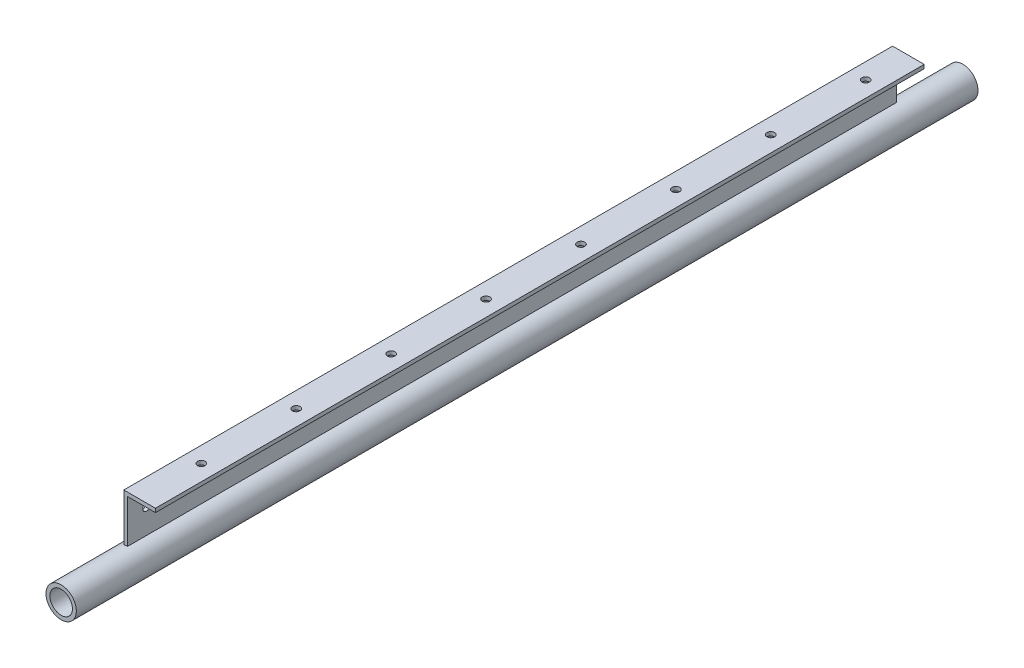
ISO-10303-21;
HEADER;
FILE_DESCRIPTION(('STEP AP214'),'2;1');
FILE_NAME('part.step','',(''),(''),'','','');
FILE_SCHEMA(('AUTOMOTIVE_DESIGN { 1 0 10303 214 1 1 1 1 }'));
ENDSEC;
DATA;
#1=APPLICATION_CONTEXT('core data for automotive mechanical design processes');
#2=APPLICATION_PROTOCOL_DEFINITION('international standard','automotive_design',2000,#1);
#3=PRODUCT_CONTEXT('',#1,'mechanical');
#4=PRODUCT('Part','Part','',(#3));
#5=PRODUCT_RELATED_PRODUCT_CATEGORY('part','',(#4));
#6=PRODUCT_DEFINITION_FORMATION('','',#4);
#7=PRODUCT_DEFINITION_CONTEXT('part definition',#1,'design');
#8=PRODUCT_DEFINITION('design','',#6,#7);
#9=PRODUCT_DEFINITION_SHAPE('','',#8);
#10=(LENGTH_UNIT() NAMED_UNIT(*) SI_UNIT(.MILLI.,.METRE.));
#11=(NAMED_UNIT(*) PLANE_ANGLE_UNIT() SI_UNIT($,.RADIAN.));
#12=(NAMED_UNIT(*) SI_UNIT($,.STERADIAN.) SOLID_ANGLE_UNIT());
#13=UNCERTAINTY_MEASURE_WITH_UNIT(LENGTH_MEASURE(1.E-05),#10,'distance_accuracy_value','');
#14=(GEOMETRIC_REPRESENTATION_CONTEXT(3) GLOBAL_UNCERTAINTY_ASSIGNED_CONTEXT((#13)) GLOBAL_UNIT_ASSIGNED_CONTEXT((#10,
#11,#12)) REPRESENTATION_CONTEXT('',''));
#15=CARTESIAN_POINT('',(0.,0.,0.));
#16=DIRECTION('',(0.,0.,1.));
#17=DIRECTION('',(1.,0.,0.));
#18=AXIS2_PLACEMENT_3D('',#15,#16,#17);
#19=CARTESIAN_POINT('',(0.,92.2379000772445,1425.));
#20=DIRECTION('',(0.,1.,0.));
#21=DIRECTION('',(0.,0.,1.));
#22=AXIS2_PLACEMENT_3D('',#19,#20,#21);
#23=PLANE('',#22);
#24=CARTESIAN_POINT('',(19.,92.2379000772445,322.5));
#25=DIRECTION('',(0.,1.,0.));
#26=DIRECTION('',(0.,0.,1.));
#27=AXIS2_PLACEMENT_3D('',#24,#25,#26);
#28=CIRCLE('',#27,6.00000000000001);
#29=CARTESIAN_POINT('',(19.,92.2379000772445,328.5));
#30=VERTEX_POINT('',#29);
#31=EDGE_CURVE('E658',#30,#30,#28,.T.);
#32=ORIENTED_EDGE('',*,*,#31,.T.);
#33=EDGE_LOOP('',(#32));
#34=FACE_BOUND('',#33,.T.);
#35=CARTESIAN_POINT('',(19.,92.2379000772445,172.5));
#36=DIRECTION('',(0.,1.,0.));
#37=DIRECTION('',(0.,0.,1.));
#38=AXIS2_PLACEMENT_3D('',#35,#36,#37);
#39=CIRCLE('',#38,6.00000000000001);
#40=CARTESIAN_POINT('',(19.,92.2379000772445,178.5));
#41=VERTEX_POINT('',#40);
#42=EDGE_CURVE('E652',#41,#41,#39,.T.);
#43=ORIENTED_EDGE('',*,*,#42,.T.);
#44=EDGE_LOOP('',(#43));
#45=FACE_BOUND('',#44,.T.);
#46=DIRECTION('',(-1.,0.,0.));
#47=VECTOR('',#46,1.);
#48=CARTESIAN_POINT('',(0.,92.2379000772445,105.));
#49=LINE('',#48,#47);
#50=CARTESIAN_POINT('',(44.,92.2379000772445,105.));
#51=VERTEX_POINT('',#50);
#52=CARTESIAN_POINT('',(0.,92.2379000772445,105.));
#53=VERTEX_POINT('',#52);
#54=EDGE_CURVE('E86',#51,#53,#49,.T.);
#55=ORIENTED_EDGE('',*,*,#54,.F.);
#56=DIRECTION('',(0.,0.,-1.));
#57=VECTOR('',#56,1.);
#58=CARTESIAN_POINT('',(44.,92.2379000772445,1425.));
#59=LINE('',#58,#57);
#60=CARTESIAN_POINT('',(44.,92.2379000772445,1320.));
#61=VERTEX_POINT('',#60);
#62=EDGE_CURVE('E100',#61,#51,#59,.T.);
#63=ORIENTED_EDGE('',*,*,#62,.F.);
#64=DIRECTION('',(1.,0.,0.));
#65=VECTOR('',#64,1.);
#66=CARTESIAN_POINT('',(0.,92.2379000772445,1320.));
#67=LINE('',#66,#65);
#68=CARTESIAN_POINT('',(0.,92.2379000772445,1320.));
#69=VERTEX_POINT('',#68);
#70=EDGE_CURVE('E637',#69,#61,#67,.T.);
#71=ORIENTED_EDGE('',*,*,#70,.F.);
#72=DIRECTION('',(0.,0.,-1.));
#73=VECTOR('',#72,1.);
#74=CARTESIAN_POINT('',(0.,92.2379000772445,1425.));
#75=LINE('',#74,#73);
#76=EDGE_CURVE('E102',#69,#53,#75,.T.);
#77=ORIENTED_EDGE('',*,*,#76,.T.);
#78=EDGE_LOOP('',(#55,#63,#71,#77));
#79=FACE_BOUND('',#78,.T.);
#80=CARTESIAN_POINT('',(19.,92.2379000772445,472.5));
#81=DIRECTION('',(0.,1.,0.));
#82=DIRECTION('',(0.,0.,1.));
#83=AXIS2_PLACEMENT_3D('',#80,#81,#82);
#84=CIRCLE('',#83,6.00000000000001);
#85=CARTESIAN_POINT('',(19.,92.2379000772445,478.5));
#86=VERTEX_POINT('',#85);
#87=EDGE_CURVE('E203',#86,#86,#84,.T.);
#88=ORIENTED_EDGE('',*,*,#87,.T.);
#89=EDGE_LOOP('',(#88));
#90=FACE_BOUND('',#89,.T.);
#91=CARTESIAN_POINT('',(19.,92.2379000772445,622.5));
#92=DIRECTION('',(0.,1.,0.));
#93=DIRECTION('',(0.,0.,1.));
#94=AXIS2_PLACEMENT_3D('',#91,#92,#93);
#95=CIRCLE('',#94,6.00000000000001);
#96=CARTESIAN_POINT('',(19.,92.2379000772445,628.5));
#97=VERTEX_POINT('',#96);
#98=EDGE_CURVE('E209',#97,#97,#95,.T.);
#99=ORIENTED_EDGE('',*,*,#98,.T.);
#100=EDGE_LOOP('',(#99));
#101=FACE_BOUND('',#100,.T.);
#102=CARTESIAN_POINT('',(19.,92.2379000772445,772.5));
#103=DIRECTION('',(0.,1.,0.));
#104=DIRECTION('',(0.,0.,1.));
#105=AXIS2_PLACEMENT_3D('',#102,#103,#104);
#106=CIRCLE('',#105,6.00000000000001);
#107=CARTESIAN_POINT('',(19.,92.2379000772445,778.5));
#108=VERTEX_POINT('',#107);
#109=EDGE_CURVE('E215',#108,#108,#106,.T.);
#110=ORIENTED_EDGE('',*,*,#109,.T.);
#111=EDGE_LOOP('',(#110));
#112=FACE_BOUND('',#111,.T.);
#113=CARTESIAN_POINT('',(19.,92.2379000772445,922.5));
#114=DIRECTION('',(0.,1.,0.));
#115=DIRECTION('',(0.,0.,1.));
#116=AXIS2_PLACEMENT_3D('',#113,#114,#115);
#117=CIRCLE('',#116,6.00000000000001);
#118=CARTESIAN_POINT('',(19.,92.2379000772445,928.5));
#119=VERTEX_POINT('',#118);
#120=EDGE_CURVE('E221',#119,#119,#117,.T.);
#121=ORIENTED_EDGE('',*,*,#120,.T.);
#122=EDGE_LOOP('',(#121));
#123=FACE_BOUND('',#122,.T.);
#124=CARTESIAN_POINT('',(19.,92.2379000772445,1072.5));
#125=DIRECTION('',(0.,1.,0.));
#126=DIRECTION('',(0.,0.,1.));
#127=AXIS2_PLACEMENT_3D('',#124,#125,#126);
#128=CIRCLE('',#127,6.00000000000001);
#129=CARTESIAN_POINT('',(19.,92.2379000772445,1078.5));
#130=VERTEX_POINT('',#129);
#131=EDGE_CURVE('E227',#130,#130,#128,.T.);
#132=ORIENTED_EDGE('',*,*,#131,.T.);
#133=EDGE_LOOP('',(#132));
#134=FACE_BOUND('',#133,.T.);
#135=CARTESIAN_POINT('',(19.,92.2379000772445,1222.5));
#136=DIRECTION('',(0.,1.,0.));
#137=DIRECTION('',(0.,0.,1.));
#138=AXIS2_PLACEMENT_3D('',#135,#136,#137);
#139=CIRCLE('',#138,6.00000000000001);
#140=CARTESIAN_POINT('',(19.,92.2379000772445,1228.5));
#141=VERTEX_POINT('',#140);
#142=EDGE_CURVE('E11',#141,#141,#139,.T.);
#143=ORIENTED_EDGE('',*,*,#142,.T.);
#144=EDGE_LOOP('',(#143));
#145=FACE_BOUND('',#144,.T.);
#146=ADVANCED_FACE('F32',(#34,#45,#79,#90,#101,#112,#123,#134,#145),#23,.F.);
#147=CARTESIAN_POINT('',(44.,98.2379000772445,1425.));
#148=DIRECTION('',(-1.,0.,0.));
#149=DIRECTION('',(0.,0.,1.));
#150=AXIS2_PLACEMENT_3D('',#147,#148,#149);
#151=PLANE('',#150);
#152=DIRECTION('',(0.,-1.,0.));
#153=VECTOR('',#152,1.);
#154=CARTESIAN_POINT('',(44.,92.2379000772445,105.));
#155=LINE('',#154,#153);
#156=CARTESIAN_POINT('',(44.,98.2379000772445,105.));
#157=VERTEX_POINT('',#156);
#158=EDGE_CURVE('E83',#157,#51,#155,.T.);
#159=ORIENTED_EDGE('',*,*,#158,.F.);
#160=DIRECTION('',(0.,0.,-1.));
#161=VECTOR('',#160,1.);
#162=CARTESIAN_POINT('',(44.,98.2379000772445,1425.));
#163=LINE('',#162,#161);
#164=CARTESIAN_POINT('',(44.,98.2379000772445,1320.));
#165=VERTEX_POINT('',#164);
#166=EDGE_CURVE('E108',#165,#157,#163,.T.);
#167=ORIENTED_EDGE('',*,*,#166,.F.);
#168=DIRECTION('',(0.,1.,0.));
#169=VECTOR('',#168,1.);
#170=CARTESIAN_POINT('',(44.,98.2379000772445,1320.));
#171=LINE('',#170,#169);
#172=EDGE_CURVE('E106',#61,#165,#171,.T.);
#173=ORIENTED_EDGE('',*,*,#172,.F.);
#174=ORIENTED_EDGE('',*,*,#62,.T.);
#175=EDGE_LOOP('',(#159,#167,#173,#174));
#176=FACE_BOUND('',#175,.T.);
#177=ADVANCED_FACE('F105',(#176),#151,.F.);
#178=CARTESIAN_POINT('',(-6.,98.2379000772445,1425.));
#179=DIRECTION('',(0.,-1.,0.));
#180=DIRECTION('',(0.,0.,-1.));
#181=AXIS2_PLACEMENT_3D('',#178,#179,#180);
#182=PLANE('',#181);
#183=CARTESIAN_POINT('',(19.,98.2379000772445,322.5));
#184=DIRECTION('',(0.,1.,0.));
#185=DIRECTION('',(0.,0.,1.));
#186=AXIS2_PLACEMENT_3D('',#183,#184,#185);
#187=CIRCLE('',#186,6.00000000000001);
#188=CARTESIAN_POINT('',(19.,98.2379000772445,328.5));
#189=VERTEX_POINT('',#188);
#190=EDGE_CURVE('E660',#189,#189,#187,.T.);
#191=ORIENTED_EDGE('',*,*,#190,.F.);
#192=EDGE_LOOP('',(#191));
#193=FACE_BOUND('',#192,.T.);
#194=CARTESIAN_POINT('',(19.,98.2379000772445,172.5));
#195=DIRECTION('',(0.,1.,0.));
#196=DIRECTION('',(0.,0.,1.));
#197=AXIS2_PLACEMENT_3D('',#194,#195,#196);
#198=CIRCLE('',#197,6.00000000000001);
#199=CARTESIAN_POINT('',(19.,98.2379000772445,178.5));
#200=VERTEX_POINT('',#199);
#201=EDGE_CURVE('E655',#200,#200,#198,.T.);
#202=ORIENTED_EDGE('',*,*,#201,.F.);
#203=EDGE_LOOP('',(#202));
#204=FACE_BOUND('',#203,.T.);
#205=DIRECTION('',(1.,0.,0.));
#206=VECTOR('',#205,1.);
#207=CARTESIAN_POINT('',(44.,98.2379000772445,105.));
#208=LINE('',#207,#206);
#209=CARTESIAN_POINT('',(-6.,98.2379000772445,105.));
#210=VERTEX_POINT('',#209);
#211=EDGE_CURVE('E88',#210,#157,#208,.T.);
#212=ORIENTED_EDGE('',*,*,#211,.F.);
#213=DIRECTION('',(0.,0.,-1.));
#214=VECTOR('',#213,1.);
#215=CARTESIAN_POINT('',(-6.,98.2379000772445,1425.));
#216=LINE('',#215,#214);
#217=CARTESIAN_POINT('',(-6.,98.2379000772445,1320.));
#218=VERTEX_POINT('',#217);
#219=EDGE_CURVE('E113',#218,#210,#216,.T.);
#220=ORIENTED_EDGE('',*,*,#219,.F.);
#221=DIRECTION('',(-1.,0.,0.));
#222=VECTOR('',#221,1.);
#223=CARTESIAN_POINT('',(-6.,98.2379000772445,1320.));
#224=LINE('',#223,#222);
#225=EDGE_CURVE('E603',#165,#218,#224,.T.);
#226=ORIENTED_EDGE('',*,*,#225,.F.);
#227=ORIENTED_EDGE('',*,*,#166,.T.);
#228=EDGE_LOOP('',(#212,#220,#226,#227));
#229=FACE_BOUND('',#228,.T.);
#230=CARTESIAN_POINT('',(19.,98.2379000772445,472.5));
#231=DIRECTION('',(0.,1.,0.));
#232=DIRECTION('',(0.,0.,1.));
#233=AXIS2_PLACEMENT_3D('',#230,#231,#232);
#234=CIRCLE('',#233,6.00000000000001);
#235=CARTESIAN_POINT('',(19.,98.2379000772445,478.5));
#236=VERTEX_POINT('',#235);
#237=EDGE_CURVE('E200',#236,#236,#234,.T.);
#238=ORIENTED_EDGE('',*,*,#237,.F.);
#239=EDGE_LOOP('',(#238));
#240=FACE_BOUND('',#239,.T.);
#241=CARTESIAN_POINT('',(19.,98.2379000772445,622.5));
#242=DIRECTION('',(0.,1.,0.));
#243=DIRECTION('',(0.,0.,1.));
#244=AXIS2_PLACEMENT_3D('',#241,#242,#243);
#245=CIRCLE('',#244,6.00000000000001);
#246=CARTESIAN_POINT('',(19.,98.2379000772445,628.5));
#247=VERTEX_POINT('',#246);
#248=EDGE_CURVE('E206',#247,#247,#245,.T.);
#249=ORIENTED_EDGE('',*,*,#248,.F.);
#250=EDGE_LOOP('',(#249));
#251=FACE_BOUND('',#250,.T.);
#252=CARTESIAN_POINT('',(19.,98.2379000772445,772.5));
#253=DIRECTION('',(0.,1.,0.));
#254=DIRECTION('',(0.,0.,1.));
#255=AXIS2_PLACEMENT_3D('',#252,#253,#254);
#256=CIRCLE('',#255,6.00000000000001);
#257=CARTESIAN_POINT('',(19.,98.2379000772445,778.5));
#258=VERTEX_POINT('',#257);
#259=EDGE_CURVE('E212',#258,#258,#256,.T.);
#260=ORIENTED_EDGE('',*,*,#259,.F.);
#261=EDGE_LOOP('',(#260));
#262=FACE_BOUND('',#261,.T.);
#263=CARTESIAN_POINT('',(19.,98.2379000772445,922.5));
#264=DIRECTION('',(0.,1.,0.));
#265=DIRECTION('',(0.,0.,1.));
#266=AXIS2_PLACEMENT_3D('',#263,#264,#265);
#267=CIRCLE('',#266,6.00000000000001);
#268=CARTESIAN_POINT('',(19.,98.2379000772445,928.5));
#269=VERTEX_POINT('',#268);
#270=EDGE_CURVE('E218',#269,#269,#267,.T.);
#271=ORIENTED_EDGE('',*,*,#270,.F.);
#272=EDGE_LOOP('',(#271));
#273=FACE_BOUND('',#272,.T.);
#274=CARTESIAN_POINT('',(19.,98.2379000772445,1072.5));
#275=DIRECTION('',(0.,1.,0.));
#276=DIRECTION('',(0.,0.,1.));
#277=AXIS2_PLACEMENT_3D('',#274,#275,#276);
#278=CIRCLE('',#277,6.00000000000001);
#279=CARTESIAN_POINT('',(19.,98.2379000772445,1078.5));
#280=VERTEX_POINT('',#279);
#281=EDGE_CURVE('E224',#280,#280,#278,.T.);
#282=ORIENTED_EDGE('',*,*,#281,.F.);
#283=EDGE_LOOP('',(#282));
#284=FACE_BOUND('',#283,.T.);
#285=CARTESIAN_POINT('',(19.,98.2379000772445,1222.5));
#286=DIRECTION('',(0.,1.,0.));
#287=DIRECTION('',(0.,0.,1.));
#288=AXIS2_PLACEMENT_3D('',#285,#286,#287);
#289=CIRCLE('',#288,6.00000000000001);
#290=CARTESIAN_POINT('',(19.,98.2379000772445,1228.5));
#291=VERTEX_POINT('',#290);
#292=EDGE_CURVE('E40',#291,#291,#289,.T.);
#293=ORIENTED_EDGE('',*,*,#292,.F.);
#294=EDGE_LOOP('',(#293));
#295=FACE_BOUND('',#294,.T.);
#296=ADVANCED_FACE('F234',(#193,#204,#229,#240,#251,#262,#273,#284,#295),#182,.F.);
#297=CARTESIAN_POINT('',(-6.,98.2379000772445,1425.));
#298=DIRECTION('',(1.,0.,0.));
#299=DIRECTION('',(0.,1.,0.));
#300=AXIS2_PLACEMENT_3D('',#297,#298,#299);
#301=PLANE('',#300);
#302=CARTESIAN_POINT('',(-6.,63.2379000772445,1215.));
#303=DIRECTION('',(-1.,0.,0.));
#304=DIRECTION('',(0.,-1.,0.));
#305=AXIS2_PLACEMENT_3D('',#302,#303,#304);
#306=CIRCLE('',#305,6.0000000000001);
#307=CARTESIAN_POINT('',(-6.,57.2379000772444,1215.));
#308=VERTEX_POINT('',#307);
#309=EDGE_CURVE('E649',#308,#308,#306,.T.);
#310=ORIENTED_EDGE('',*,*,#309,.F.);
#311=EDGE_LOOP('',(#310));
#312=FACE_BOUND('',#311,.T.);
#313=CARTESIAN_POINT('',(-6.,63.2379000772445,1290.));
#314=DIRECTION('',(-1.,0.,0.));
#315=DIRECTION('',(0.,-1.,0.));
#316=AXIS2_PLACEMENT_3D('',#313,#314,#315);
#317=CIRCLE('',#316,6.0000000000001);
#318=CARTESIAN_POINT('',(-6.,57.2379000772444,1290.));
#319=VERTEX_POINT('',#318);
#320=EDGE_CURVE('E118',#319,#319,#317,.T.);
#321=ORIENTED_EDGE('',*,*,#320,.F.);
#322=EDGE_LOOP('',(#321));
#323=FACE_BOUND('',#322,.T.);
#324=DIRECTION('',(0.,1.,0.));
#325=VECTOR('',#324,1.);
#326=CARTESIAN_POINT('',(-5.99999999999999,23.2379000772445,105.));
#327=LINE('',#326,#325);
#328=CARTESIAN_POINT('',(-5.99999999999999,23.2379000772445,105.));
#329=VERTEX_POINT('',#328);
#330=EDGE_CURVE('E625',#329,#210,#327,.T.);
#331=ORIENTED_EDGE('',*,*,#330,.F.);
#332=DIRECTION('',(0.,0.,-1.));
#333=VECTOR('',#332,1.);
#334=CARTESIAN_POINT('',(-5.99999999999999,23.2379000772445,1425.));
#335=LINE('',#334,#333);
#336=CARTESIAN_POINT('',(-5.99999999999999,23.2379000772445,1320.));
#337=VERTEX_POINT('',#336);
#338=EDGE_CURVE('E616',#337,#329,#335,.T.);
#339=ORIENTED_EDGE('',*,*,#338,.F.);
#340=DIRECTION('',(0.,-1.,0.));
#341=VECTOR('',#340,1.);
#342=CARTESIAN_POINT('',(-6.,98.2379000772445,1320.));
#343=LINE('',#342,#341);
#344=EDGE_CURVE('E599',#218,#337,#343,.T.);
#345=ORIENTED_EDGE('',*,*,#344,.F.);
#346=ORIENTED_EDGE('',*,*,#219,.T.);
#347=EDGE_LOOP('',(#331,#339,#345,#346));
#348=FACE_BOUND('',#347,.T.);
#349=CARTESIAN_POINT('',(-6.,63.2379000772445,1140.));
#350=DIRECTION('',(-1.,0.,0.));
#351=DIRECTION('',(0.,-1.,0.));
#352=AXIS2_PLACEMENT_3D('',#349,#350,#351);
#353=CIRCLE('',#352,6.0000000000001);
#354=CARTESIAN_POINT('',(-6.,57.2379000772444,1140.));
#355=VERTEX_POINT('',#354);
#356=EDGE_CURVE('E107',#355,#355,#353,.T.);
#357=ORIENTED_EDGE('',*,*,#356,.F.);
#358=EDGE_LOOP('',(#357));
#359=FACE_BOUND('',#358,.T.);
#360=CARTESIAN_POINT('',(-6.,63.2379000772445,1065.));
#361=DIRECTION('',(-1.,0.,0.));
#362=DIRECTION('',(0.,-1.,0.));
#363=AXIS2_PLACEMENT_3D('',#360,#361,#362);
#364=CIRCLE('',#363,6.0000000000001);
#365=CARTESIAN_POINT('',(-6.,57.2379000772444,1065.));
#366=VERTEX_POINT('',#365);
#367=EDGE_CURVE('E122',#366,#366,#364,.T.);
#368=ORIENTED_EDGE('',*,*,#367,.F.);
#369=EDGE_LOOP('',(#368));
#370=FACE_BOUND('',#369,.T.);
#371=CARTESIAN_POINT('',(-6.,63.2379000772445,990.));
#372=DIRECTION('',(-1.,0.,0.));
#373=DIRECTION('',(0.,-1.,0.));
#374=AXIS2_PLACEMENT_3D('',#371,#372,#373);
#375=CIRCLE('',#374,6.0000000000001);
#376=CARTESIAN_POINT('',(-6.,57.2379000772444,990.));
#377=VERTEX_POINT('',#376);
#378=EDGE_CURVE('E128',#377,#377,#375,.T.);
#379=ORIENTED_EDGE('',*,*,#378,.F.);
#380=EDGE_LOOP('',(#379));
#381=FACE_BOUND('',#380,.T.);
#382=CARTESIAN_POINT('',(-6.,63.2379000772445,915.));
#383=DIRECTION('',(-1.,0.,0.));
#384=DIRECTION('',(0.,-1.,0.));
#385=AXIS2_PLACEMENT_3D('',#382,#383,#384);
#386=CIRCLE('',#385,6.0000000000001);
#387=CARTESIAN_POINT('',(-6.,57.2379000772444,915.));
#388=VERTEX_POINT('',#387);
#389=EDGE_CURVE('E134',#388,#388,#386,.T.);
#390=ORIENTED_EDGE('',*,*,#389,.F.);
#391=EDGE_LOOP('',(#390));
#392=FACE_BOUND('',#391,.T.);
#393=CARTESIAN_POINT('',(-6.,63.2379000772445,840.));
#394=DIRECTION('',(-1.,0.,0.));
#395=DIRECTION('',(0.,-1.,0.));
#396=AXIS2_PLACEMENT_3D('',#393,#394,#395);
#397=CIRCLE('',#396,6.0000000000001);
#398=CARTESIAN_POINT('',(-6.,57.2379000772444,840.));
#399=VERTEX_POINT('',#398);
#400=EDGE_CURVE('E140',#399,#399,#397,.T.);
#401=ORIENTED_EDGE('',*,*,#400,.F.);
#402=EDGE_LOOP('',(#401));
#403=FACE_BOUND('',#402,.T.);
#404=CARTESIAN_POINT('',(-6.,63.2379000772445,765.));
#405=DIRECTION('',(-1.,0.,0.));
#406=DIRECTION('',(0.,-1.,0.));
#407=AXIS2_PLACEMENT_3D('',#404,#405,#406);
#408=CIRCLE('',#407,6.0000000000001);
#409=CARTESIAN_POINT('',(-6.,57.2379000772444,765.));
#410=VERTEX_POINT('',#409);
#411=EDGE_CURVE('E146',#410,#410,#408,.T.);
#412=ORIENTED_EDGE('',*,*,#411,.F.);
#413=EDGE_LOOP('',(#412));
#414=FACE_BOUND('',#413,.T.);
#415=CARTESIAN_POINT('',(-6.,63.2379000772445,690.));
#416=DIRECTION('',(-1.,0.,0.));
#417=DIRECTION('',(0.,-1.,0.));
#418=AXIS2_PLACEMENT_3D('',#415,#416,#417);
#419=CIRCLE('',#418,6.0000000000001);
#420=CARTESIAN_POINT('',(-5.99999999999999,57.2379000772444,690.));
#421=VERTEX_POINT('',#420);
#422=EDGE_CURVE('E152',#421,#421,#419,.T.);
#423=ORIENTED_EDGE('',*,*,#422,.F.);
#424=EDGE_LOOP('',(#423));
#425=FACE_BOUND('',#424,.T.);
#426=CARTESIAN_POINT('',(-6.,63.2379000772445,615.));
#427=DIRECTION('',(-1.,0.,0.));
#428=DIRECTION('',(0.,-1.,0.));
#429=AXIS2_PLACEMENT_3D('',#426,#427,#428);
#430=CIRCLE('',#429,6.0000000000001);
#431=CARTESIAN_POINT('',(-5.99999999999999,57.2379000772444,615.));
#432=VERTEX_POINT('',#431);
#433=EDGE_CURVE('E158',#432,#432,#430,.T.);
#434=ORIENTED_EDGE('',*,*,#433,.F.);
#435=EDGE_LOOP('',(#434));
#436=FACE_BOUND('',#435,.T.);
#437=CARTESIAN_POINT('',(-5.99999999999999,63.2379000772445,540.));
#438=DIRECTION('',(-1.,0.,0.));
#439=DIRECTION('',(0.,-1.,0.));
#440=AXIS2_PLACEMENT_3D('',#437,#438,#439);
#441=CIRCLE('',#440,6.0000000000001);
#442=CARTESIAN_POINT('',(-5.99999999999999,57.2379000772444,540.));
#443=VERTEX_POINT('',#442);
#444=EDGE_CURVE('E164',#443,#443,#441,.T.);
#445=ORIENTED_EDGE('',*,*,#444,.F.);
#446=EDGE_LOOP('',(#445));
#447=FACE_BOUND('',#446,.T.);
#448=CARTESIAN_POINT('',(-5.99999999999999,63.2379000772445,465.));
#449=DIRECTION('',(-1.,0.,0.));
#450=DIRECTION('',(0.,-1.,0.));
#451=AXIS2_PLACEMENT_3D('',#448,#449,#450);
#452=CIRCLE('',#451,6.0000000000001);
#453=CARTESIAN_POINT('',(-5.99999999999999,57.2379000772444,465.));
#454=VERTEX_POINT('',#453);
#455=EDGE_CURVE('E170',#454,#454,#452,.T.);
#456=ORIENTED_EDGE('',*,*,#455,.F.);
#457=EDGE_LOOP('',(#456));
#458=FACE_BOUND('',#457,.T.);
#459=CARTESIAN_POINT('',(-5.99999999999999,63.2379000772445,390.));
#460=DIRECTION('',(-1.,0.,0.));
#461=DIRECTION('',(0.,-1.,0.));
#462=AXIS2_PLACEMENT_3D('',#459,#460,#461);
#463=CIRCLE('',#462,6.0000000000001);
#464=CARTESIAN_POINT('',(-5.99999999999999,57.2379000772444,390.));
#465=VERTEX_POINT('',#464);
#466=EDGE_CURVE('E176',#465,#465,#463,.T.);
#467=ORIENTED_EDGE('',*,*,#466,.F.);
#468=EDGE_LOOP('',(#467));
#469=FACE_BOUND('',#468,.T.);
#470=CARTESIAN_POINT('',(-5.99999999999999,63.2379000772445,315.));
#471=DIRECTION('',(-1.,0.,0.));
#472=DIRECTION('',(0.,-1.,0.));
#473=AXIS2_PLACEMENT_3D('',#470,#471,#472);
#474=CIRCLE('',#473,6.0000000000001);
#475=CARTESIAN_POINT('',(-5.99999999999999,57.2379000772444,315.));
#476=VERTEX_POINT('',#475);
#477=EDGE_CURVE('E182',#476,#476,#474,.T.);
#478=ORIENTED_EDGE('',*,*,#477,.F.);
#479=EDGE_LOOP('',(#478));
#480=FACE_BOUND('',#479,.T.);
#481=CARTESIAN_POINT('',(-5.99999999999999,63.2379000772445,240.));
#482=DIRECTION('',(-1.,0.,0.));
#483=DIRECTION('',(0.,-1.,0.));
#484=AXIS2_PLACEMENT_3D('',#481,#482,#483);
#485=CIRCLE('',#484,6.0000000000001);
#486=CARTESIAN_POINT('',(-5.99999999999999,57.2379000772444,240.));
#487=VERTEX_POINT('',#486);
#488=EDGE_CURVE('E188',#487,#487,#485,.T.);
#489=ORIENTED_EDGE('',*,*,#488,.F.);
#490=EDGE_LOOP('',(#489));
#491=FACE_BOUND('',#490,.T.);
#492=CARTESIAN_POINT('',(-5.99999999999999,63.2379000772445,165.));
#493=DIRECTION('',(-1.,0.,0.));
#494=DIRECTION('',(0.,-1.,0.));
#495=AXIS2_PLACEMENT_3D('',#492,#493,#494);
#496=CIRCLE('',#495,6.0000000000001);
#497=CARTESIAN_POINT('',(-5.99999999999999,57.2379000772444,165.));
#498=VERTEX_POINT('',#497);
#499=EDGE_CURVE('E194',#498,#498,#496,.T.);
#500=ORIENTED_EDGE('',*,*,#499,.F.);
#501=EDGE_LOOP('',(#500));
#502=FACE_BOUND('',#501,.T.);
#503=ADVANCED_FACE('F236',(#312,#323,#348,#359,#370,#381,#392,#403,#414,#425,#436,#447,#458,
#469,#480,#491,#502),#301,.F.);
#504=CARTESIAN_POINT('',(0.,92.2379000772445,1425.));
#505=DIRECTION('',(-1.,0.,0.));
#506=DIRECTION('',(0.,-1.,0.));
#507=AXIS2_PLACEMENT_3D('',#504,#505,#506);
#508=PLANE('',#507);
#509=CARTESIAN_POINT('',(0.,63.2379000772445,1215.));
#510=DIRECTION('',(-1.,0.,0.));
#511=DIRECTION('',(0.,-1.,0.));
#512=AXIS2_PLACEMENT_3D('',#509,#510,#511);
#513=CIRCLE('',#512,6.0000000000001);
#514=CARTESIAN_POINT('',(0.,57.2379000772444,1215.));
#515=VERTEX_POINT('',#514);
#516=EDGE_CURVE('E646',#515,#515,#513,.T.);
#517=ORIENTED_EDGE('',*,*,#516,.T.);
#518=EDGE_LOOP('',(#517));
#519=FACE_BOUND('',#518,.T.);
#520=CARTESIAN_POINT('',(0.,63.2379000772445,1290.));
#521=DIRECTION('',(-1.,0.,0.));
#522=DIRECTION('',(0.,-1.,0.));
#523=AXIS2_PLACEMENT_3D('',#520,#521,#522);
#524=CIRCLE('',#523,6.0000000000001);
#525=CARTESIAN_POINT('',(0.,57.2379000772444,1290.));
#526=VERTEX_POINT('',#525);
#527=EDGE_CURVE('E93',#526,#526,#524,.T.);
#528=ORIENTED_EDGE('',*,*,#527,.T.);
#529=EDGE_LOOP('',(#528));
#530=FACE_BOUND('',#529,.T.);
#531=DIRECTION('',(0.,-1.,0.));
#532=VECTOR('',#531,1.);
#533=CARTESIAN_POINT('',(0.,24.,105.));
#534=LINE('',#533,#532);
#535=CARTESIAN_POINT('',(0.,24.,105.));
#536=VERTEX_POINT('',#535);
#537=EDGE_CURVE('E47',#53,#536,#534,.T.);
#538=ORIENTED_EDGE('',*,*,#537,.F.);
#539=ORIENTED_EDGE('',*,*,#76,.F.);
#540=DIRECTION('',(0.,1.,0.));
#541=VECTOR('',#540,1.);
#542=CARTESIAN_POINT('',(0.,92.2379000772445,1320.));
#543=LINE('',#542,#541);
#544=CARTESIAN_POINT('',(0.,24.,1320.));
#545=VERTEX_POINT('',#544);
#546=EDGE_CURVE('E630',#545,#69,#543,.T.);
#547=ORIENTED_EDGE('',*,*,#546,.F.);
#548=DIRECTION('',(0.,0.,-1.));
#549=VECTOR('',#548,1.);
#550=CARTESIAN_POINT('',(0.,24.,1425.));
#551=LINE('',#550,#549);
#552=EDGE_CURVE('E613',#545,#536,#551,.T.);
#553=ORIENTED_EDGE('',*,*,#552,.T.);
#554=EDGE_LOOP('',(#538,#539,#547,#553));
#555=FACE_BOUND('',#554,.T.);
#556=CARTESIAN_POINT('',(0.,63.2379000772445,1140.));
#557=DIRECTION('',(-1.,0.,0.));
#558=DIRECTION('',(0.,-1.,0.));
#559=AXIS2_PLACEMENT_3D('',#556,#557,#558);
#560=CIRCLE('',#559,6.0000000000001);
#561=CARTESIAN_POINT('',(0.,57.2379000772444,1140.));
#562=VERTEX_POINT('',#561);
#563=EDGE_CURVE('E111',#562,#562,#560,.T.);
#564=ORIENTED_EDGE('',*,*,#563,.T.);
#565=EDGE_LOOP('',(#564));
#566=FACE_BOUND('',#565,.T.);
#567=CARTESIAN_POINT('',(0.,63.2379000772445,1065.));
#568=DIRECTION('',(-1.,0.,0.));
#569=DIRECTION('',(0.,-1.,0.));
#570=AXIS2_PLACEMENT_3D('',#567,#568,#569);
#571=CIRCLE('',#570,6.0000000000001);
#572=CARTESIAN_POINT('',(0.,57.2379000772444,1065.));
#573=VERTEX_POINT('',#572);
#574=EDGE_CURVE('E125',#573,#573,#571,.T.);
#575=ORIENTED_EDGE('',*,*,#574,.T.);
#576=EDGE_LOOP('',(#575));
#577=FACE_BOUND('',#576,.T.);
#578=CARTESIAN_POINT('',(0.,63.2379000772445,990.));
#579=DIRECTION('',(-1.,0.,0.));
#580=DIRECTION('',(0.,-1.,0.));
#581=AXIS2_PLACEMENT_3D('',#578,#579,#580);
#582=CIRCLE('',#581,6.0000000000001);
#583=CARTESIAN_POINT('',(0.,57.2379000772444,990.));
#584=VERTEX_POINT('',#583);
#585=EDGE_CURVE('E131',#584,#584,#582,.T.);
#586=ORIENTED_EDGE('',*,*,#585,.T.);
#587=EDGE_LOOP('',(#586));
#588=FACE_BOUND('',#587,.T.);
#589=CARTESIAN_POINT('',(0.,63.2379000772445,915.));
#590=DIRECTION('',(-1.,0.,0.));
#591=DIRECTION('',(0.,-1.,0.));
#592=AXIS2_PLACEMENT_3D('',#589,#590,#591);
#593=CIRCLE('',#592,6.0000000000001);
#594=CARTESIAN_POINT('',(0.,57.2379000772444,915.));
#595=VERTEX_POINT('',#594);
#596=EDGE_CURVE('E137',#595,#595,#593,.T.);
#597=ORIENTED_EDGE('',*,*,#596,.T.);
#598=EDGE_LOOP('',(#597));
#599=FACE_BOUND('',#598,.T.);
#600=CARTESIAN_POINT('',(0.,63.2379000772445,840.));
#601=DIRECTION('',(-1.,0.,0.));
#602=DIRECTION('',(0.,-1.,0.));
#603=AXIS2_PLACEMENT_3D('',#600,#601,#602);
#604=CIRCLE('',#603,6.0000000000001);
#605=CARTESIAN_POINT('',(0.,57.2379000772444,840.));
#606=VERTEX_POINT('',#605);
#607=EDGE_CURVE('E143',#606,#606,#604,.T.);
#608=ORIENTED_EDGE('',*,*,#607,.T.);
#609=EDGE_LOOP('',(#608));
#610=FACE_BOUND('',#609,.T.);
#611=CARTESIAN_POINT('',(0.,63.2379000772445,765.));
#612=DIRECTION('',(-1.,0.,0.));
#613=DIRECTION('',(0.,-1.,0.));
#614=AXIS2_PLACEMENT_3D('',#611,#612,#613);
#615=CIRCLE('',#614,6.0000000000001);
#616=CARTESIAN_POINT('',(0.,57.2379000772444,765.));
#617=VERTEX_POINT('',#616);
#618=EDGE_CURVE('E149',#617,#617,#615,.T.);
#619=ORIENTED_EDGE('',*,*,#618,.T.);
#620=EDGE_LOOP('',(#619));
#621=FACE_BOUND('',#620,.T.);
#622=CARTESIAN_POINT('',(0.,63.2379000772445,690.));
#623=DIRECTION('',(-1.,0.,0.));
#624=DIRECTION('',(0.,-1.,0.));
#625=AXIS2_PLACEMENT_3D('',#622,#623,#624);
#626=CIRCLE('',#625,6.0000000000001);
#627=CARTESIAN_POINT('',(0.,57.2379000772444,690.));
#628=VERTEX_POINT('',#627);
#629=EDGE_CURVE('E155',#628,#628,#626,.T.);
#630=ORIENTED_EDGE('',*,*,#629,.T.);
#631=EDGE_LOOP('',(#630));
#632=FACE_BOUND('',#631,.T.);
#633=CARTESIAN_POINT('',(0.,63.2379000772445,615.));
#634=DIRECTION('',(-1.,0.,0.));
#635=DIRECTION('',(0.,-1.,0.));
#636=AXIS2_PLACEMENT_3D('',#633,#634,#635);
#637=CIRCLE('',#636,6.0000000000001);
#638=CARTESIAN_POINT('',(0.,57.2379000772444,615.));
#639=VERTEX_POINT('',#638);
#640=EDGE_CURVE('E161',#639,#639,#637,.T.);
#641=ORIENTED_EDGE('',*,*,#640,.T.);
#642=EDGE_LOOP('',(#641));
#643=FACE_BOUND('',#642,.T.);
#644=CARTESIAN_POINT('',(0.,63.2379000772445,540.));
#645=DIRECTION('',(-1.,0.,0.));
#646=DIRECTION('',(0.,-1.,0.));
#647=AXIS2_PLACEMENT_3D('',#644,#645,#646);
#648=CIRCLE('',#647,6.0000000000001);
#649=CARTESIAN_POINT('',(0.,57.2379000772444,540.));
#650=VERTEX_POINT('',#649);
#651=EDGE_CURVE('E167',#650,#650,#648,.T.);
#652=ORIENTED_EDGE('',*,*,#651,.T.);
#653=EDGE_LOOP('',(#652));
#654=FACE_BOUND('',#653,.T.);
#655=CARTESIAN_POINT('',(0.,63.2379000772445,465.));
#656=DIRECTION('',(-1.,0.,0.));
#657=DIRECTION('',(0.,-1.,0.));
#658=AXIS2_PLACEMENT_3D('',#655,#656,#657);
#659=CIRCLE('',#658,6.0000000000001);
#660=CARTESIAN_POINT('',(0.,57.2379000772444,465.));
#661=VERTEX_POINT('',#660);
#662=EDGE_CURVE('E173',#661,#661,#659,.T.);
#663=ORIENTED_EDGE('',*,*,#662,.T.);
#664=EDGE_LOOP('',(#663));
#665=FACE_BOUND('',#664,.T.);
#666=CARTESIAN_POINT('',(0.,63.2379000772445,390.));
#667=DIRECTION('',(-1.,0.,0.));
#668=DIRECTION('',(0.,-1.,0.));
#669=AXIS2_PLACEMENT_3D('',#666,#667,#668);
#670=CIRCLE('',#669,6.0000000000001);
#671=CARTESIAN_POINT('',(0.,57.2379000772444,390.));
#672=VERTEX_POINT('',#671);
#673=EDGE_CURVE('E179',#672,#672,#670,.T.);
#674=ORIENTED_EDGE('',*,*,#673,.T.);
#675=EDGE_LOOP('',(#674));
#676=FACE_BOUND('',#675,.T.);
#677=CARTESIAN_POINT('',(0.,63.2379000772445,315.));
#678=DIRECTION('',(-1.,0.,0.));
#679=DIRECTION('',(0.,-1.,0.));
#680=AXIS2_PLACEMENT_3D('',#677,#678,#679);
#681=CIRCLE('',#680,6.0000000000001);
#682=CARTESIAN_POINT('',(0.,57.2379000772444,315.));
#683=VERTEX_POINT('',#682);
#684=EDGE_CURVE('E185',#683,#683,#681,.T.);
#685=ORIENTED_EDGE('',*,*,#684,.T.);
#686=EDGE_LOOP('',(#685));
#687=FACE_BOUND('',#686,.T.);
#688=CARTESIAN_POINT('',(0.,63.2379000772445,240.));
#689=DIRECTION('',(-1.,0.,0.));
#690=DIRECTION('',(0.,-1.,0.));
#691=AXIS2_PLACEMENT_3D('',#688,#689,#690);
#692=CIRCLE('',#691,6.0000000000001);
#693=CARTESIAN_POINT('',(0.,57.2379000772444,240.));
#694=VERTEX_POINT('',#693);
#695=EDGE_CURVE('E191',#694,#694,#692,.T.);
#696=ORIENTED_EDGE('',*,*,#695,.T.);
#697=EDGE_LOOP('',(#696));
#698=FACE_BOUND('',#697,.T.);
#699=CARTESIAN_POINT('',(0.,63.2379000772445,165.));
#700=DIRECTION('',(-1.,0.,0.));
#701=DIRECTION('',(0.,-1.,0.));
#702=AXIS2_PLACEMENT_3D('',#699,#700,#701);
#703=CIRCLE('',#702,6.0000000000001);
#704=CARTESIAN_POINT('',(0.,57.2379000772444,165.));
#705=VERTEX_POINT('',#704);
#706=EDGE_CURVE('E197',#705,#705,#703,.T.);
#707=ORIENTED_EDGE('',*,*,#706,.T.);
#708=EDGE_LOOP('',(#707));
#709=FACE_BOUND('',#708,.T.);
#710=ADVANCED_FACE('F243',(#519,#530,#555,#566,#577,#588,#599,#610,#621,#632,#643,#654,#665,
#676,#687,#698,#709),#508,.F.);
#711=CARTESIAN_POINT('',(0.,0.,1425.));
#712=DIRECTION('',(0.,0.,1.));
#713=DIRECTION('',(1.,0.,0.));
#714=AXIS2_PLACEMENT_3D('',#711,#712,#713);
#715=PLANE('',#714);
#716=CARTESIAN_POINT('',(0.,0.,1425.));
#717=DIRECTION('',(0.,0.,1.));
#718=DIRECTION('',(1.,0.,0.));
#719=AXIS2_PLACEMENT_3D('',#716,#717,#718);
#720=CIRCLE('',#719,24.);
#721=CARTESIAN_POINT('',(24.,0.,1425.));
#722=VERTEX_POINT('',#721);
#723=EDGE_CURVE('E609',#722,#722,#720,.T.);
#724=ORIENTED_EDGE('',*,*,#723,.T.);
#725=EDGE_LOOP('',(#724));
#726=FACE_BOUND('',#725,.T.);
#727=CARTESIAN_POINT('',(0.,0.,1425.));
#728=DIRECTION('',(0.,0.,1.));
#729=DIRECTION('',(1.,0.,0.));
#730=AXIS2_PLACEMENT_3D('',#727,#728,#729);
#731=CIRCLE('',#730,17.85);
#732=CARTESIAN_POINT('',(17.85,0.,1425.));
#733=VERTEX_POINT('',#732);
#734=EDGE_CURVE('E594',#733,#733,#731,.T.);
#735=ORIENTED_EDGE('',*,*,#734,.F.);
#736=EDGE_LOOP('',(#735));
#737=FACE_BOUND('',#736,.T.);
#738=ADVANCED_FACE('F508',(#726,#737),#715,.T.);
#739=CARTESIAN_POINT('',(0.,0.,0.));
#740=DIRECTION('',(0.,0.,1.));
#741=DIRECTION('',(1.,0.,0.));
#742=AXIS2_PLACEMENT_3D('',#739,#740,#741);
#743=PLANE('',#742);
#744=CARTESIAN_POINT('',(0.,0.,0.));
#745=DIRECTION('',(0.,0.,1.));
#746=DIRECTION('',(1.,0.,0.));
#747=AXIS2_PLACEMENT_3D('',#744,#745,#746);
#748=CIRCLE('',#747,24.);
#749=CARTESIAN_POINT('',(24.,0.,0.));
#750=VERTEX_POINT('',#749);
#751=EDGE_CURVE('E601',#750,#750,#748,.T.);
#752=ORIENTED_EDGE('',*,*,#751,.F.);
#753=EDGE_LOOP('',(#752));
#754=FACE_BOUND('',#753,.T.);
#755=CARTESIAN_POINT('',(0.,0.,0.));
#756=DIRECTION('',(0.,0.,1.));
#757=DIRECTION('',(1.,0.,0.));
#758=AXIS2_PLACEMENT_3D('',#755,#756,#757);
#759=CIRCLE('',#758,17.85);
#760=CARTESIAN_POINT('',(17.85,0.,0.));
#761=VERTEX_POINT('',#760);
#762=EDGE_CURVE('E597',#761,#761,#759,.T.);
#763=ORIENTED_EDGE('',*,*,#762,.T.);
#764=EDGE_LOOP('',(#763));
#765=FACE_BOUND('',#764,.T.);
#766=ADVANCED_FACE('F543',(#754,#765),#743,.F.);
#767=CARTESIAN_POINT('',(0.,0.,1425.));
#768=DIRECTION('',(0.,0.,-1.));
#769=DIRECTION('',(-1.,0.,0.));
#770=AXIS2_PLACEMENT_3D('',#767,#768,#769);
#771=CYLINDRICAL_SURFACE('',#770,24.);
#772=ORIENTED_EDGE('',*,*,#751,.T.);
#773=EDGE_LOOP('',(#772));
#774=FACE_BOUND('',#773,.T.);
#775=CARTESIAN_POINT('',(0.,0.,1320.));
#776=DIRECTION('',(0.,0.,-1.));
#777=DIRECTION('',(1.,0.,0.));
#778=AXIS2_PLACEMENT_3D('',#775,#776,#777);
#779=CIRCLE('',#778,24.);
#780=EDGE_CURVE('E55',#337,#545,#779,.T.);
#781=ORIENTED_EDGE('',*,*,#780,.F.);
#782=ORIENTED_EDGE('',*,*,#338,.T.);
#783=CARTESIAN_POINT('',(0.,0.,105.));
#784=DIRECTION('',(0.,0.,1.));
#785=DIRECTION('',(-1.,0.,0.));
#786=AXIS2_PLACEMENT_3D('',#783,#784,#785);
#787=CIRCLE('',#786,24.);
#788=EDGE_CURVE('E632',#536,#329,#787,.T.);
#789=ORIENTED_EDGE('',*,*,#788,.F.);
#790=ORIENTED_EDGE('',*,*,#552,.F.);
#791=EDGE_LOOP('',(#781,#782,#789,#790));
#792=FACE_BOUND('',#791,.T.);
#793=ORIENTED_EDGE('',*,*,#723,.F.);
#794=EDGE_LOOP('',(#793));
#795=FACE_BOUND('',#794,.T.);
#796=ADVANCED_FACE('F538',(#774,#792,#795),#771,.T.);
#797=CARTESIAN_POINT('',(0.,0.,1425.));
#798=DIRECTION('',(0.,0.,-1.));
#799=DIRECTION('',(-1.,0.,0.));
#800=AXIS2_PLACEMENT_3D('',#797,#798,#799);
#801=CYLINDRICAL_SURFACE('',#800,17.85);
#802=ORIENTED_EDGE('',*,*,#734,.T.);
#803=EDGE_LOOP('',(#802));
#804=FACE_BOUND('',#803,.T.);
#805=ORIENTED_EDGE('',*,*,#762,.F.);
#806=EDGE_LOOP('',(#805));
#807=FACE_BOUND('',#806,.T.);
#808=ADVANCED_FACE('F542',(#804,#807),#801,.F.);
#809=CARTESIAN_POINT('',(0.,0.,1320.));
#810=DIRECTION('',(0.,0.,1.));
#811=DIRECTION('',(1.,0.,0.));
#812=AXIS2_PLACEMENT_3D('',#809,#810,#811);
#813=PLANE('',#812);
#814=ORIENTED_EDGE('',*,*,#780,.T.);
#815=ORIENTED_EDGE('',*,*,#546,.T.);
#816=ORIENTED_EDGE('',*,*,#70,.T.);
#817=ORIENTED_EDGE('',*,*,#172,.T.);
#818=ORIENTED_EDGE('',*,*,#225,.T.);
#819=ORIENTED_EDGE('',*,*,#344,.T.);
#820=EDGE_LOOP('',(#814,#815,#816,#817,#818,#819));
#821=FACE_BOUND('',#820,.T.);
#822=ADVANCED_FACE('F532',(#821),#813,.T.);
#823=CARTESIAN_POINT('',(0.,0.,105.));
#824=DIRECTION('',(0.,0.,-1.));
#825=DIRECTION('',(-1.,0.,0.));
#826=AXIS2_PLACEMENT_3D('',#823,#824,#825);
#827=PLANE('',#826);
#828=ORIENTED_EDGE('',*,*,#158,.T.);
#829=ORIENTED_EDGE('',*,*,#54,.T.);
#830=ORIENTED_EDGE('',*,*,#537,.T.);
#831=ORIENTED_EDGE('',*,*,#788,.T.);
#832=ORIENTED_EDGE('',*,*,#330,.T.);
#833=ORIENTED_EDGE('',*,*,#211,.T.);
#834=EDGE_LOOP('',(#828,#829,#830,#831,#832,#833));
#835=FACE_BOUND('',#834,.T.);
#836=ADVANCED_FACE('F85',(#835),#827,.T.);
#837=CARTESIAN_POINT('',(44.,63.2379000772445,1290.));
#838=DIRECTION('',(-1.,0.,0.));
#839=DIRECTION('',(0.,-1.,0.));
#840=AXIS2_PLACEMENT_3D('',#837,#838,#839);
#841=CYLINDRICAL_SURFACE('',#840,6.0000000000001);
#842=ORIENTED_EDGE('',*,*,#320,.T.);
#843=EDGE_LOOP('',(#842));
#844=FACE_BOUND('',#843,.T.);
#845=ORIENTED_EDGE('',*,*,#527,.F.);
#846=EDGE_LOOP('',(#845));
#847=FACE_BOUND('',#846,.T.);
#848=ADVANCED_FACE('F496',(#844,#847),#841,.F.);
#849=CARTESIAN_POINT('',(44.,63.2379000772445,1215.));
#850=DIRECTION('',(-1.,0.,0.));
#851=DIRECTION('',(0.,-1.,0.));
#852=AXIS2_PLACEMENT_3D('',#849,#850,#851);
#853=CYLINDRICAL_SURFACE('',#852,6.0000000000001);
#854=ORIENTED_EDGE('',*,*,#309,.T.);
#855=EDGE_LOOP('',(#854));
#856=FACE_BOUND('',#855,.T.);
#857=ORIENTED_EDGE('',*,*,#516,.F.);
#858=EDGE_LOOP('',(#857));
#859=FACE_BOUND('',#858,.T.);
#860=ADVANCED_FACE('F261',(#856,#859),#853,.F.);
#861=CARTESIAN_POINT('',(44.,63.2379000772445,1140.));
#862=DIRECTION('',(-1.,0.,0.));
#863=DIRECTION('',(0.,-1.,0.));
#864=AXIS2_PLACEMENT_3D('',#861,#862,#863);
#865=CYLINDRICAL_SURFACE('',#864,6.0000000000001);
#866=ORIENTED_EDGE('',*,*,#356,.T.);
#867=EDGE_LOOP('',(#866));
#868=FACE_BOUND('',#867,.T.);
#869=ORIENTED_EDGE('',*,*,#563,.F.);
#870=EDGE_LOOP('',(#869));
#871=FACE_BOUND('',#870,.T.);
#872=ADVANCED_FACE('F257',(#868,#871),#865,.F.);
#873=CARTESIAN_POINT('',(44.,63.2379000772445,1065.));
#874=DIRECTION('',(-1.,0.,0.));
#875=DIRECTION('',(0.,-1.,0.));
#876=AXIS2_PLACEMENT_3D('',#873,#874,#875);
#877=CYLINDRICAL_SURFACE('',#876,6.0000000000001);
#878=ORIENTED_EDGE('',*,*,#367,.T.);
#879=EDGE_LOOP('',(#878));
#880=FACE_BOUND('',#879,.T.);
#881=ORIENTED_EDGE('',*,*,#574,.F.);
#882=EDGE_LOOP('',(#881));
#883=FACE_BOUND('',#882,.T.);
#884=ADVANCED_FACE('F260',(#880,#883),#877,.F.);
#885=CARTESIAN_POINT('',(44.,63.2379000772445,990.));
#886=DIRECTION('',(-1.,0.,0.));
#887=DIRECTION('',(0.,-1.,0.));
#888=AXIS2_PLACEMENT_3D('',#885,#886,#887);
#889=CYLINDRICAL_SURFACE('',#888,6.0000000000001);
#890=ORIENTED_EDGE('',*,*,#378,.T.);
#891=EDGE_LOOP('',(#890));
#892=FACE_BOUND('',#891,.T.);
#893=ORIENTED_EDGE('',*,*,#585,.F.);
#894=EDGE_LOOP('',(#893));
#895=FACE_BOUND('',#894,.T.);
#896=ADVANCED_FACE('F265',(#892,#895),#889,.F.);
#897=CARTESIAN_POINT('',(44.,63.2379000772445,915.));
#898=DIRECTION('',(-1.,0.,0.));
#899=DIRECTION('',(0.,-1.,0.));
#900=AXIS2_PLACEMENT_3D('',#897,#898,#899);
#901=CYLINDRICAL_SURFACE('',#900,6.0000000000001);
#902=ORIENTED_EDGE('',*,*,#389,.T.);
#903=EDGE_LOOP('',(#902));
#904=FACE_BOUND('',#903,.T.);
#905=ORIENTED_EDGE('',*,*,#596,.F.);
#906=EDGE_LOOP('',(#905));
#907=FACE_BOUND('',#906,.T.);
#908=ADVANCED_FACE('F269',(#904,#907),#901,.F.);
#909=CARTESIAN_POINT('',(44.,63.2379000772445,840.));
#910=DIRECTION('',(-1.,0.,0.));
#911=DIRECTION('',(0.,-1.,0.));
#912=AXIS2_PLACEMENT_3D('',#909,#910,#911);
#913=CYLINDRICAL_SURFACE('',#912,6.0000000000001);
#914=ORIENTED_EDGE('',*,*,#400,.T.);
#915=EDGE_LOOP('',(#914));
#916=FACE_BOUND('',#915,.T.);
#917=ORIENTED_EDGE('',*,*,#607,.F.);
#918=EDGE_LOOP('',(#917));
#919=FACE_BOUND('',#918,.T.);
#920=ADVANCED_FACE('F273',(#916,#919),#913,.F.);
#921=CARTESIAN_POINT('',(44.,63.2379000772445,765.));
#922=DIRECTION('',(-1.,0.,0.));
#923=DIRECTION('',(0.,-1.,0.));
#924=AXIS2_PLACEMENT_3D('',#921,#922,#923);
#925=CYLINDRICAL_SURFACE('',#924,6.0000000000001);
#926=ORIENTED_EDGE('',*,*,#411,.T.);
#927=EDGE_LOOP('',(#926));
#928=FACE_BOUND('',#927,.T.);
#929=ORIENTED_EDGE('',*,*,#618,.F.);
#930=EDGE_LOOP('',(#929));
#931=FACE_BOUND('',#930,.T.);
#932=ADVANCED_FACE('F277',(#928,#931),#925,.F.);
#933=CARTESIAN_POINT('',(44.,63.2379000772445,690.));
#934=DIRECTION('',(-1.,0.,0.));
#935=DIRECTION('',(0.,-1.,0.));
#936=AXIS2_PLACEMENT_3D('',#933,#934,#935);
#937=CYLINDRICAL_SURFACE('',#936,6.0000000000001);
#938=ORIENTED_EDGE('',*,*,#422,.T.);
#939=EDGE_LOOP('',(#938));
#940=FACE_BOUND('',#939,.T.);
#941=ORIENTED_EDGE('',*,*,#629,.F.);
#942=EDGE_LOOP('',(#941));
#943=FACE_BOUND('',#942,.T.);
#944=ADVANCED_FACE('F281',(#940,#943),#937,.F.);
#945=CARTESIAN_POINT('',(44.,63.2379000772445,615.));
#946=DIRECTION('',(-1.,0.,0.));
#947=DIRECTION('',(0.,-1.,0.));
#948=AXIS2_PLACEMENT_3D('',#945,#946,#947);
#949=CYLINDRICAL_SURFACE('',#948,6.0000000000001);
#950=ORIENTED_EDGE('',*,*,#433,.T.);
#951=EDGE_LOOP('',(#950));
#952=FACE_BOUND('',#951,.T.);
#953=ORIENTED_EDGE('',*,*,#640,.F.);
#954=EDGE_LOOP('',(#953));
#955=FACE_BOUND('',#954,.T.);
#956=ADVANCED_FACE('F285',(#952,#955),#949,.F.);
#957=CARTESIAN_POINT('',(44.,63.2379000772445,540.));
#958=DIRECTION('',(-1.,0.,0.));
#959=DIRECTION('',(0.,-1.,0.));
#960=AXIS2_PLACEMENT_3D('',#957,#958,#959);
#961=CYLINDRICAL_SURFACE('',#960,6.0000000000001);
#962=ORIENTED_EDGE('',*,*,#444,.T.);
#963=EDGE_LOOP('',(#962));
#964=FACE_BOUND('',#963,.T.);
#965=ORIENTED_EDGE('',*,*,#651,.F.);
#966=EDGE_LOOP('',(#965));
#967=FACE_BOUND('',#966,.T.);
#968=ADVANCED_FACE('F289',(#964,#967),#961,.F.);
#969=CARTESIAN_POINT('',(44.,63.2379000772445,465.));
#970=DIRECTION('',(-1.,0.,0.));
#971=DIRECTION('',(0.,-1.,0.));
#972=AXIS2_PLACEMENT_3D('',#969,#970,#971);
#973=CYLINDRICAL_SURFACE('',#972,6.0000000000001);
#974=ORIENTED_EDGE('',*,*,#455,.T.);
#975=EDGE_LOOP('',(#974));
#976=FACE_BOUND('',#975,.T.);
#977=ORIENTED_EDGE('',*,*,#662,.F.);
#978=EDGE_LOOP('',(#977));
#979=FACE_BOUND('',#978,.T.);
#980=ADVANCED_FACE('F293',(#976,#979),#973,.F.);
#981=CARTESIAN_POINT('',(44.,63.2379000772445,390.));
#982=DIRECTION('',(-1.,0.,0.));
#983=DIRECTION('',(0.,-1.,0.));
#984=AXIS2_PLACEMENT_3D('',#981,#982,#983);
#985=CYLINDRICAL_SURFACE('',#984,6.0000000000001);
#986=ORIENTED_EDGE('',*,*,#466,.T.);
#987=EDGE_LOOP('',(#986));
#988=FACE_BOUND('',#987,.T.);
#989=ORIENTED_EDGE('',*,*,#673,.F.);
#990=EDGE_LOOP('',(#989));
#991=FACE_BOUND('',#990,.T.);
#992=ADVANCED_FACE('F297',(#988,#991),#985,.F.);
#993=CARTESIAN_POINT('',(44.,63.2379000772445,315.));
#994=DIRECTION('',(-1.,0.,0.));
#995=DIRECTION('',(0.,-1.,0.));
#996=AXIS2_PLACEMENT_3D('',#993,#994,#995);
#997=CYLINDRICAL_SURFACE('',#996,6.0000000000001);
#998=ORIENTED_EDGE('',*,*,#477,.T.);
#999=EDGE_LOOP('',(#998));
#1000=FACE_BOUND('',#999,.T.);
#1001=ORIENTED_EDGE('',*,*,#684,.F.);
#1002=EDGE_LOOP('',(#1001));
#1003=FACE_BOUND('',#1002,.T.);
#1004=ADVANCED_FACE('F301',(#1000,#1003),#997,.F.);
#1005=CARTESIAN_POINT('',(44.,63.2379000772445,240.));
#1006=DIRECTION('',(-1.,0.,0.));
#1007=DIRECTION('',(0.,-1.,0.));
#1008=AXIS2_PLACEMENT_3D('',#1005,#1006,#1007);
#1009=CYLINDRICAL_SURFACE('',#1008,6.0000000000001);
#1010=ORIENTED_EDGE('',*,*,#488,.T.);
#1011=EDGE_LOOP('',(#1010));
#1012=FACE_BOUND('',#1011,.T.);
#1013=ORIENTED_EDGE('',*,*,#695,.F.);
#1014=EDGE_LOOP('',(#1013));
#1015=FACE_BOUND('',#1014,.T.);
#1016=ADVANCED_FACE('F305',(#1012,#1015),#1009,.F.);
#1017=CARTESIAN_POINT('',(44.,63.2379000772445,165.));
#1018=DIRECTION('',(-1.,0.,0.));
#1019=DIRECTION('',(0.,-1.,0.));
#1020=AXIS2_PLACEMENT_3D('',#1017,#1018,#1019);
#1021=CYLINDRICAL_SURFACE('',#1020,6.0000000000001);
#1022=ORIENTED_EDGE('',*,*,#499,.T.);
#1023=EDGE_LOOP('',(#1022));
#1024=FACE_BOUND('',#1023,.T.);
#1025=ORIENTED_EDGE('',*,*,#706,.F.);
#1026=EDGE_LOOP('',(#1025));
#1027=FACE_BOUND('',#1026,.T.);
#1028=ADVANCED_FACE('F309',(#1024,#1027),#1021,.F.);
#1029=CARTESIAN_POINT('',(19.,91.2379000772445,172.5));
#1030=DIRECTION('',(0.,1.,0.));
#1031=DIRECTION('',(0.,0.,1.));
#1032=AXIS2_PLACEMENT_3D('',#1029,#1030,#1031);
#1033=CYLINDRICAL_SURFACE('',#1032,6.00000000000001);
#1034=ORIENTED_EDGE('',*,*,#201,.T.);
#1035=EDGE_LOOP('',(#1034));
#1036=FACE_BOUND('',#1035,.T.);
#1037=ORIENTED_EDGE('',*,*,#42,.F.);
#1038=EDGE_LOOP('',(#1037));
#1039=FACE_BOUND('',#1038,.T.);
#1040=ADVANCED_FACE('F313',(#1036,#1039),#1033,.F.);
#1041=CARTESIAN_POINT('',(19.,91.2379000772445,322.5));
#1042=DIRECTION('',(0.,1.,0.));
#1043=DIRECTION('',(0.,0.,1.));
#1044=AXIS2_PLACEMENT_3D('',#1041,#1042,#1043);
#1045=CYLINDRICAL_SURFACE('',#1044,6.00000000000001);
#1046=ORIENTED_EDGE('',*,*,#190,.T.);
#1047=EDGE_LOOP('',(#1046));
#1048=FACE_BOUND('',#1047,.T.);
#1049=ORIENTED_EDGE('',*,*,#31,.F.);
#1050=EDGE_LOOP('',(#1049));
#1051=FACE_BOUND('',#1050,.T.);
#1052=ADVANCED_FACE('F319',(#1048,#1051),#1045,.F.);
#1053=CARTESIAN_POINT('',(19.,91.2379000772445,472.5));
#1054=DIRECTION('',(0.,1.,0.));
#1055=DIRECTION('',(0.,0.,1.));
#1056=AXIS2_PLACEMENT_3D('',#1053,#1054,#1055);
#1057=CYLINDRICAL_SURFACE('',#1056,6.00000000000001);
#1058=ORIENTED_EDGE('',*,*,#237,.T.);
#1059=EDGE_LOOP('',(#1058));
#1060=FACE_BOUND('',#1059,.T.);
#1061=ORIENTED_EDGE('',*,*,#87,.F.);
#1062=EDGE_LOOP('',(#1061));
#1063=FACE_BOUND('',#1062,.T.);
#1064=ADVANCED_FACE('F315',(#1060,#1063),#1057,.F.);
#1065=CARTESIAN_POINT('',(19.,91.2379000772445,622.5));
#1066=DIRECTION('',(0.,1.,0.));
#1067=DIRECTION('',(0.,0.,1.));
#1068=AXIS2_PLACEMENT_3D('',#1065,#1066,#1067);
#1069=CYLINDRICAL_SURFACE('',#1068,6.00000000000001);
#1070=ORIENTED_EDGE('',*,*,#248,.T.);
#1071=EDGE_LOOP('',(#1070));
#1072=FACE_BOUND('',#1071,.T.);
#1073=ORIENTED_EDGE('',*,*,#98,.F.);
#1074=EDGE_LOOP('',(#1073));
#1075=FACE_BOUND('',#1074,.T.);
#1076=ADVANCED_FACE('F318',(#1072,#1075),#1069,.F.);
#1077=CARTESIAN_POINT('',(19.,91.2379000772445,772.5));
#1078=DIRECTION('',(0.,1.,0.));
#1079=DIRECTION('',(0.,0.,1.));
#1080=AXIS2_PLACEMENT_3D('',#1077,#1078,#1079);
#1081=CYLINDRICAL_SURFACE('',#1080,6.00000000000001);
#1082=ORIENTED_EDGE('',*,*,#259,.T.);
#1083=EDGE_LOOP('',(#1082));
#1084=FACE_BOUND('',#1083,.T.);
#1085=ORIENTED_EDGE('',*,*,#109,.F.);
#1086=EDGE_LOOP('',(#1085));
#1087=FACE_BOUND('',#1086,.T.);
#1088=ADVANCED_FACE('F323',(#1084,#1087),#1081,.F.);
#1089=CARTESIAN_POINT('',(19.,91.2379000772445,922.5));
#1090=DIRECTION('',(0.,1.,0.));
#1091=DIRECTION('',(0.,0.,1.));
#1092=AXIS2_PLACEMENT_3D('',#1089,#1090,#1091);
#1093=CYLINDRICAL_SURFACE('',#1092,6.00000000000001);
#1094=ORIENTED_EDGE('',*,*,#270,.T.);
#1095=EDGE_LOOP('',(#1094));
#1096=FACE_BOUND('',#1095,.T.);
#1097=ORIENTED_EDGE('',*,*,#120,.F.);
#1098=EDGE_LOOP('',(#1097));
#1099=FACE_BOUND('',#1098,.T.);
#1100=ADVANCED_FACE('F327',(#1096,#1099),#1093,.F.);
#1101=CARTESIAN_POINT('',(19.,91.2379000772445,1072.5));
#1102=DIRECTION('',(0.,1.,0.));
#1103=DIRECTION('',(0.,0.,1.));
#1104=AXIS2_PLACEMENT_3D('',#1101,#1102,#1103);
#1105=CYLINDRICAL_SURFACE('',#1104,6.00000000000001);
#1106=ORIENTED_EDGE('',*,*,#281,.T.);
#1107=EDGE_LOOP('',(#1106));
#1108=FACE_BOUND('',#1107,.T.);
#1109=ORIENTED_EDGE('',*,*,#131,.F.);
#1110=EDGE_LOOP('',(#1109));
#1111=FACE_BOUND('',#1110,.T.);
#1112=ADVANCED_FACE('F330',(#1108,#1111),#1105,.F.);
#1113=CARTESIAN_POINT('',(19.,91.2379000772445,1222.5));
#1114=DIRECTION('',(0.,1.,0.));
#1115=DIRECTION('',(0.,0.,1.));
#1116=AXIS2_PLACEMENT_3D('',#1113,#1114,#1115);
#1117=CYLINDRICAL_SURFACE('',#1116,6.00000000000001);
#1118=ORIENTED_EDGE('',*,*,#292,.T.);
#1119=EDGE_LOOP('',(#1118));
#1120=FACE_BOUND('',#1119,.T.);
#1121=ORIENTED_EDGE('',*,*,#142,.F.);
#1122=EDGE_LOOP('',(#1121));
#1123=FACE_BOUND('',#1122,.T.);
#1124=ADVANCED_FACE('F34',(#1120,#1123),#1117,.F.);
#1125=CLOSED_SHELL('',(#146,#177,#296,#503,#710,#738,#766,#796,#808,#822,#836,#848,#860,#872,
#884,#896,#908,#920,#932,#944,#956,#968,#980,#992,#1004,#1016,#1028,#1040,#1052,#1064,#1076,
#1088,#1100,#1112,#1124));
#1126=MANIFOLD_SOLID_BREP('B2',#1125);
#1127=ADVANCED_BREP_SHAPE_REPRESENTATION('',(#18,#1126),#14);
#1128=SHAPE_DEFINITION_REPRESENTATION(#9,#1127);
ENDSEC;
END-ISO-10303-21;
